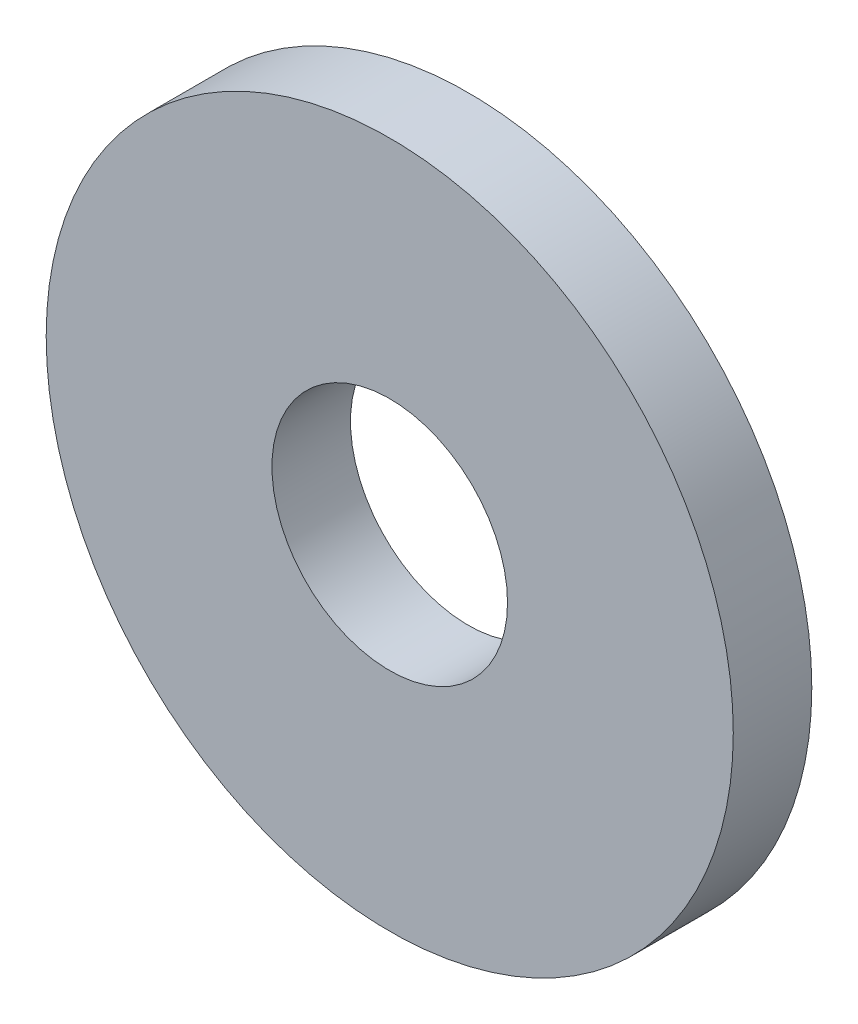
ISO-10303-21;
HEADER;
FILE_DESCRIPTION(('STEP AP214'),'2;1');
FILE_NAME('part.step','',(''),(''),'','','');
FILE_SCHEMA(('AUTOMOTIVE_DESIGN { 1 0 10303 214 1 1 1 1 }'));
ENDSEC;
DATA;
#1=APPLICATION_CONTEXT('core data for automotive mechanical design processes');
#2=APPLICATION_PROTOCOL_DEFINITION('international standard','automotive_design',2000,#1);
#3=PRODUCT_CONTEXT('',#1,'mechanical');
#4=PRODUCT('Part','Part','',(#3));
#5=PRODUCT_RELATED_PRODUCT_CATEGORY('part','',(#4));
#6=PRODUCT_DEFINITION_FORMATION('','',#4);
#7=PRODUCT_DEFINITION_CONTEXT('part definition',#1,'design');
#8=PRODUCT_DEFINITION('design','',#6,#7);
#9=PRODUCT_DEFINITION_SHAPE('','',#8);
#10=(LENGTH_UNIT() NAMED_UNIT(*) SI_UNIT(.MILLI.,.METRE.));
#11=(NAMED_UNIT(*) PLANE_ANGLE_UNIT() SI_UNIT($,.RADIAN.));
#12=(NAMED_UNIT(*) SI_UNIT($,.STERADIAN.) SOLID_ANGLE_UNIT());
#13=UNCERTAINTY_MEASURE_WITH_UNIT(LENGTH_MEASURE(1.E-05),#10,'distance_accuracy_value','');
#14=(GEOMETRIC_REPRESENTATION_CONTEXT(3) GLOBAL_UNCERTAINTY_ASSIGNED_CONTEXT((#13)) GLOBAL_UNIT_ASSIGNED_CONTEXT((#10,
#11,#12)) REPRESENTATION_CONTEXT('',''));
#15=CARTESIAN_POINT('',(0.,0.,0.));
#16=DIRECTION('',(0.,0.,1.));
#17=DIRECTION('',(1.,0.,0.));
#18=AXIS2_PLACEMENT_3D('',#15,#16,#17);
#19=CARTESIAN_POINT('',(0.,0.,2.));
#20=DIRECTION('',(0.,0.,-1.));
#21=DIRECTION('',(-1.,0.,0.));
#22=AXIS2_PLACEMENT_3D('',#19,#20,#21);
#23=PLANE('',#22);
#24=CARTESIAN_POINT('',(0.,0.,2.));
#25=DIRECTION('',(0.,0.,1.));
#26=DIRECTION('',(1.,0.,0.));
#27=AXIS2_PLACEMENT_3D('',#24,#25,#26);
#28=CIRCLE('',#27,3.);
#29=CARTESIAN_POINT('',(3.,0.,2.));
#30=VERTEX_POINT('',#29);
#31=EDGE_CURVE('E34',#30,#30,#28,.F.);
#32=ORIENTED_EDGE('',*,*,#31,.T.);
#33=EDGE_LOOP('',(#32));
#34=FACE_BOUND('',#33,.T.);
#35=CARTESIAN_POINT('',(0.,0.,2.));
#36=DIRECTION('',(0.,0.,1.));
#37=DIRECTION('',(1.,0.,0.));
#38=AXIS2_PLACEMENT_3D('',#35,#36,#37);
#39=CIRCLE('',#38,8.75);
#40=CARTESIAN_POINT('',(8.75,0.,2.));
#41=VERTEX_POINT('',#40);
#42=EDGE_CURVE('E20',#41,#41,#39,.F.);
#43=ORIENTED_EDGE('',*,*,#42,.F.);
#44=EDGE_LOOP('',(#43));
#45=FACE_BOUND('',#44,.T.);
#46=ADVANCED_FACE('F17',(#34,#45),#23,.F.);
#47=CARTESIAN_POINT('',(0.,0.,0.));
#48=DIRECTION('',(0.,0.,1.));
#49=DIRECTION('',(1.,0.,0.));
#50=AXIS2_PLACEMENT_3D('',#47,#48,#49);
#51=CYLINDRICAL_SURFACE('',#50,8.75);
#52=CARTESIAN_POINT('',(0.,0.,0.));
#53=DIRECTION('',(0.,0.,1.));
#54=DIRECTION('',(1.,0.,0.));
#55=AXIS2_PLACEMENT_3D('',#52,#53,#54);
#56=CIRCLE('',#55,8.75);
#57=CARTESIAN_POINT('',(8.75,0.,0.));
#58=VERTEX_POINT('',#57);
#59=EDGE_CURVE('E25',#58,#58,#56,.F.);
#60=ORIENTED_EDGE('',*,*,#59,.F.);
#61=EDGE_LOOP('',(#60));
#62=FACE_BOUND('',#61,.T.);
#63=ORIENTED_EDGE('',*,*,#42,.T.);
#64=EDGE_LOOP('',(#63));
#65=FACE_BOUND('',#64,.T.);
#66=ADVANCED_FACE('F42',(#62,#65),#51,.T.);
#67=CARTESIAN_POINT('',(0.,0.,0.));
#68=DIRECTION('',(0.,0.,1.));
#69=DIRECTION('',(1.,0.,0.));
#70=AXIS2_PLACEMENT_3D('',#67,#68,#69);
#71=CYLINDRICAL_SURFACE('',#70,3.);
#72=CARTESIAN_POINT('',(0.,0.,0.));
#73=DIRECTION('',(0.,0.,1.));
#74=DIRECTION('',(1.,0.,0.));
#75=AXIS2_PLACEMENT_3D('',#72,#73,#74);
#76=CIRCLE('',#75,3.);
#77=CARTESIAN_POINT('',(3.,0.,0.));
#78=VERTEX_POINT('',#77);
#79=EDGE_CURVE('E10',#78,#78,#76,.T.);
#80=ORIENTED_EDGE('',*,*,#79,.F.);
#81=EDGE_LOOP('',(#80));
#82=FACE_BOUND('',#81,.T.);
#83=ORIENTED_EDGE('',*,*,#31,.F.);
#84=EDGE_LOOP('',(#83));
#85=FACE_BOUND('',#84,.T.);
#86=ADVANCED_FACE('F49',(#82,#85),#71,.F.);
#87=CARTESIAN_POINT('',(0.,0.,0.));
#88=DIRECTION('',(0.,0.,-1.));
#89=DIRECTION('',(-1.,0.,0.));
#90=AXIS2_PLACEMENT_3D('',#87,#88,#89);
#91=PLANE('',#90);
#92=ORIENTED_EDGE('',*,*,#79,.T.);
#93=EDGE_LOOP('',(#92));
#94=FACE_BOUND('',#93,.T.);
#95=ORIENTED_EDGE('',*,*,#59,.T.);
#96=EDGE_LOOP('',(#95));
#97=FACE_BOUND('',#96,.T.);
#98=ADVANCED_FACE('F51',(#94,#97),#91,.T.);
#99=CLOSED_SHELL('',(#46,#66,#86,#98));
#100=MANIFOLD_SOLID_BREP('B1',#99);
#101=ADVANCED_BREP_SHAPE_REPRESENTATION('',(#18,#100),#14);
#102=SHAPE_DEFINITION_REPRESENTATION(#9,#101);
ENDSEC;
END-ISO-10303-21;
